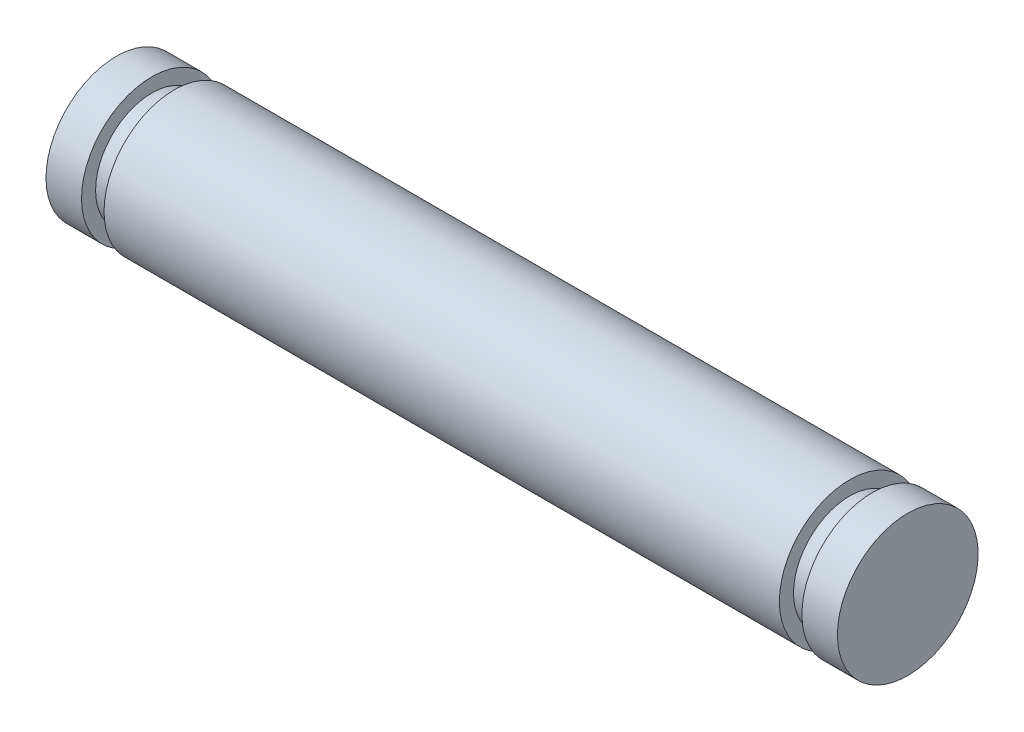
ISO-10303-21;
HEADER;
FILE_DESCRIPTION(('STEP AP214'),'2;1');
FILE_NAME('part.step','',(''),(''),'','','');
FILE_SCHEMA(('AUTOMOTIVE_DESIGN { 1 0 10303 214 1 1 1 1 }'));
ENDSEC;
DATA;
#1=APPLICATION_CONTEXT('core data for automotive mechanical design processes');
#2=APPLICATION_PROTOCOL_DEFINITION('international standard','automotive_design',2000,#1);
#3=PRODUCT_CONTEXT('',#1,'mechanical');
#4=PRODUCT('Part','Part','',(#3));
#5=PRODUCT_RELATED_PRODUCT_CATEGORY('part','',(#4));
#6=PRODUCT_DEFINITION_FORMATION('','',#4);
#7=PRODUCT_DEFINITION_CONTEXT('part definition',#1,'design');
#8=PRODUCT_DEFINITION('design','',#6,#7);
#9=PRODUCT_DEFINITION_SHAPE('','',#8);
#10=(LENGTH_UNIT() NAMED_UNIT(*) SI_UNIT(.MILLI.,.METRE.));
#11=(NAMED_UNIT(*) PLANE_ANGLE_UNIT() SI_UNIT($,.RADIAN.));
#12=(NAMED_UNIT(*) SI_UNIT($,.STERADIAN.) SOLID_ANGLE_UNIT());
#13=UNCERTAINTY_MEASURE_WITH_UNIT(LENGTH_MEASURE(1.E-05),#10,'distance_accuracy_value','');
#14=(GEOMETRIC_REPRESENTATION_CONTEXT(3) GLOBAL_UNCERTAINTY_ASSIGNED_CONTEXT((#13)) GLOBAL_UNIT_ASSIGNED_CONTEXT((#10,
#11,#12)) REPRESENTATION_CONTEXT('',''));
#15=CARTESIAN_POINT('',(0.,0.,0.));
#16=DIRECTION('',(0.,0.,1.));
#17=DIRECTION('',(1.,0.,0.));
#18=AXIS2_PLACEMENT_3D('',#15,#16,#17);
#19=CARTESIAN_POINT('',(11.25,0.,0.));
#20=DIRECTION('',(-1.,0.,0.));
#21=DIRECTION('',(0.,0.,1.));
#22=AXIS2_PLACEMENT_3D('',#19,#20,#21);
#23=CYLINDRICAL_SURFACE('',#22,2.);
#24=CARTESIAN_POINT('',(-9.6,0.,0.));
#25=DIRECTION('',(-1.,0.,0.));
#26=DIRECTION('',(0.,0.,1.));
#27=AXIS2_PLACEMENT_3D('',#24,#25,#26);
#28=CIRCLE('',#27,2.);
#29=CARTESIAN_POINT('',(-9.6,0.,2.));
#30=VERTEX_POINT('',#29);
#31=EDGE_CURVE('E49',#30,#30,#28,.T.);
#32=CARTESIAN_POINT('',(9.6,0.,0.));
#33=DIRECTION('',(-1.,0.,0.));
#34=DIRECTION('',(0.,0.,1.));
#35=AXIS2_PLACEMENT_3D('',#32,#33,#34);
#36=CIRCLE('',#35,2.);
#37=CARTESIAN_POINT('',(9.6,0.,2.));
#38=VERTEX_POINT('',#37);
#39=EDGE_CURVE('E61',#38,#38,#36,.T.);
#40=CARTESIAN_POINT('',(-9.6,0.,2.));
#41=CARTESIAN_POINT('',(-9.4,0.,2.));
#42=CARTESIAN_POINT('',(-9.2,0.,2.));
#43=CARTESIAN_POINT('',(-8.8,0.,2.));
#44=CARTESIAN_POINT('',(-8.6,0.,2.));
#45=CARTESIAN_POINT('',(-8.2,0.,2.));
#46=CARTESIAN_POINT('',(-8.,0.,2.));
#47=CARTESIAN_POINT('',(-7.6,0.,2.));
#48=CARTESIAN_POINT('',(-7.4,0.,2.));
#49=CARTESIAN_POINT('',(-7.,0.,2.));
#50=CARTESIAN_POINT('',(-6.8,0.,2.));
#51=CARTESIAN_POINT('',(-6.4,0.,2.));
#52=CARTESIAN_POINT('',(-6.2,0.,2.));
#53=CARTESIAN_POINT('',(-5.8,0.,2.));
#54=CARTESIAN_POINT('',(-5.6,0.,2.));
#55=CARTESIAN_POINT('',(-5.2,0.,2.));
#56=CARTESIAN_POINT('',(-5.,0.,2.));
#57=CARTESIAN_POINT('',(-4.6,0.,2.));
#58=CARTESIAN_POINT('',(-4.4,0.,2.));
#59=CARTESIAN_POINT('',(-4.,0.,2.));
#60=CARTESIAN_POINT('',(-3.8,0.,2.));
#61=CARTESIAN_POINT('',(-3.4,0.,2.));
#62=CARTESIAN_POINT('',(-3.2,0.,2.));
#63=CARTESIAN_POINT('',(-2.8,0.,2.));
#64=CARTESIAN_POINT('',(-2.6,0.,2.));
#65=CARTESIAN_POINT('',(-2.2,0.,2.));
#66=CARTESIAN_POINT('',(-2.,0.,2.));
#67=CARTESIAN_POINT('',(-1.6,0.,2.));
#68=CARTESIAN_POINT('',(-1.4,0.,2.));
#69=CARTESIAN_POINT('',(-0.999999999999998,0.,2.));
#70=CARTESIAN_POINT('',(-0.799999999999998,0.,2.));
#71=CARTESIAN_POINT('',(-0.399999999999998,0.,2.));
#72=CARTESIAN_POINT('',(-0.199999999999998,0.,2.));
#73=CARTESIAN_POINT('',(0.200000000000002,0.,2.));
#74=CARTESIAN_POINT('',(0.400000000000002,0.,2.));
#75=CARTESIAN_POINT('',(0.800000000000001,0.,2.));
#76=CARTESIAN_POINT('',(1.,0.,2.));
#77=CARTESIAN_POINT('',(1.4,0.,2.));
#78=CARTESIAN_POINT('',(1.6,0.,2.));
#79=CARTESIAN_POINT('',(2.,0.,2.));
#80=CARTESIAN_POINT('',(2.2,0.,2.));
#81=CARTESIAN_POINT('',(2.6,0.,2.));
#82=CARTESIAN_POINT('',(2.8,0.,2.));
#83=CARTESIAN_POINT('',(3.2,0.,2.));
#84=CARTESIAN_POINT('',(3.4,0.,2.));
#85=CARTESIAN_POINT('',(3.8,0.,2.));
#86=CARTESIAN_POINT('',(4.,0.,2.));
#87=CARTESIAN_POINT('',(4.4,0.,2.));
#88=CARTESIAN_POINT('',(4.6,0.,2.));
#89=CARTESIAN_POINT('',(5.,0.,2.));
#90=CARTESIAN_POINT('',(5.2,0.,2.));
#91=CARTESIAN_POINT('',(5.6,0.,2.));
#92=CARTESIAN_POINT('',(5.8,0.,2.));
#93=CARTESIAN_POINT('',(6.2,0.,2.));
#94=CARTESIAN_POINT('',(6.4,0.,2.));
#95=CARTESIAN_POINT('',(6.8,0.,2.));
#96=CARTESIAN_POINT('',(7.,0.,2.));
#97=CARTESIAN_POINT('',(7.4,0.,2.));
#98=CARTESIAN_POINT('',(7.6,0.,2.));
#99=CARTESIAN_POINT('',(8.,0.,2.));
#100=CARTESIAN_POINT('',(8.2,0.,2.));
#101=CARTESIAN_POINT('',(8.6,0.,2.));
#102=CARTESIAN_POINT('',(8.8,0.,2.));
#103=CARTESIAN_POINT('',(9.2,0.,2.));
#104=CARTESIAN_POINT('',(9.4,0.,2.));
#105=CARTESIAN_POINT('',(9.6,0.,2.));
#106=B_SPLINE_CURVE_WITH_KNOTS('',3,(#40,#41,#42,#43,#44,#45,#46,#47,#48,#49,#50,#51,#52,#53,
#54,#55,#56,#57,#58,#59,#60,#61,#62,#63,#64,#65,#66,#67,#68,#69,#70,#71,#72,#73,#74,#75,#76,#77,
#78,#79,#80,#81,#82,#83,#84,#85,#86,#87,#88,#89,#90,#91,#92,#93,#94,#95,#96,#97,#98,#99,#100,
#101,#102,#103,#104,#105),.UNSPECIFIED.,.F.,.F.,(4,2,2,2,2,2,2,2,2,2,2,2,2,2,2,2,2,2,2,2,2,2,2,
2,2,2,2,2,2,2,2,2,4),(0.,0.6,1.2,1.8,2.4,3.,3.6,4.2,4.8,5.4,6.,6.6,7.2,7.8,8.4,9.,9.6,10.2,10.8,
11.4,12.,12.6,13.2,13.8,14.4,15.,15.6,16.2,16.8,17.4,18.,18.6,19.2),.UNSPECIFIED.);
#107=EDGE_CURVE('BSEAM31',#30,#38,#106,.T.);
#108=ORIENTED_EDGE('',*,*,#31,.F.);
#109=ORIENTED_EDGE('',*,*,#39,.T.);
#110=ORIENTED_EDGE('',*,*,#107,.T.);
#111=ORIENTED_EDGE('',*,*,#107,.F.);
#112=EDGE_LOOP('',(#108,#110,#109,#111));
#113=FACE_BOUND('',#112,.T.);
#114=ADVANCED_FACE('F31',(#113),#23,.T.);
#115=CARTESIAN_POINT('',(-11.25,0.,0.));
#116=DIRECTION('',(1.,0.,0.));
#117=DIRECTION('',(0.,0.,-1.));
#118=AXIS2_PLACEMENT_3D('',#115,#116,#117);
#119=CIRCLE('',#118,2.);
#120=CARTESIAN_POINT('',(-11.25,0.,2.));
#121=VERTEX_POINT('',#120);
#122=EDGE_CURVE('E35',#121,#121,#119,.T.);
#123=CARTESIAN_POINT('',(-10.24,0.,0.));
#124=DIRECTION('',(-1.,0.,0.));
#125=DIRECTION('',(0.,0.,1.));
#126=AXIS2_PLACEMENT_3D('',#123,#124,#125);
#127=CIRCLE('',#126,2.);
#128=CARTESIAN_POINT('',(-10.24,0.,2.));
#129=VERTEX_POINT('',#128);
#130=EDGE_CURVE('E52',#129,#129,#127,.T.);
#131=CARTESIAN_POINT('',(-11.25,0.,2.));
#132=CARTESIAN_POINT('',(-11.2394791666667,0.,2.));
#133=CARTESIAN_POINT('',(-11.2289583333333,0.,2.));
#134=CARTESIAN_POINT('',(-11.2079166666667,0.,2.));
#135=CARTESIAN_POINT('',(-11.1973958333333,0.,2.));
#136=CARTESIAN_POINT('',(-11.1763541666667,0.,2.));
#137=CARTESIAN_POINT('',(-11.1658333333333,0.,2.));
#138=CARTESIAN_POINT('',(-11.1447916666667,0.,2.));
#139=CARTESIAN_POINT('',(-11.1342708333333,0.,2.));
#140=CARTESIAN_POINT('',(-11.1132291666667,0.,2.));
#141=CARTESIAN_POINT('',(-11.1027083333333,0.,2.));
#142=CARTESIAN_POINT('',(-11.0816666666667,0.,2.));
#143=CARTESIAN_POINT('',(-11.0711458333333,0.,2.));
#144=CARTESIAN_POINT('',(-11.0501041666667,0.,2.));
#145=CARTESIAN_POINT('',(-11.0395833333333,0.,2.));
#146=CARTESIAN_POINT('',(-11.0185416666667,0.,2.));
#147=CARTESIAN_POINT('',(-11.0080208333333,0.,2.));
#148=CARTESIAN_POINT('',(-10.9869791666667,0.,2.));
#149=CARTESIAN_POINT('',(-10.9764583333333,0.,2.));
#150=CARTESIAN_POINT('',(-10.9554166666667,0.,2.));
#151=CARTESIAN_POINT('',(-10.9448958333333,0.,2.));
#152=CARTESIAN_POINT('',(-10.9238541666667,0.,2.));
#153=CARTESIAN_POINT('',(-10.9133333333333,0.,2.));
#154=CARTESIAN_POINT('',(-10.8922916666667,0.,2.));
#155=CARTESIAN_POINT('',(-10.8817708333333,0.,2.));
#156=CARTESIAN_POINT('',(-10.8607291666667,0.,2.));
#157=CARTESIAN_POINT('',(-10.8502083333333,0.,2.));
#158=CARTESIAN_POINT('',(-10.8291666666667,0.,2.));
#159=CARTESIAN_POINT('',(-10.8186458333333,0.,2.));
#160=CARTESIAN_POINT('',(-10.7976041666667,0.,2.));
#161=CARTESIAN_POINT('',(-10.7870833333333,0.,2.));
#162=CARTESIAN_POINT('',(-10.7660416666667,0.,2.));
#163=CARTESIAN_POINT('',(-10.7555208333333,0.,2.));
#164=CARTESIAN_POINT('',(-10.7344791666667,0.,2.));
#165=CARTESIAN_POINT('',(-10.7239583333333,0.,2.));
#166=CARTESIAN_POINT('',(-10.7029166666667,0.,2.));
#167=CARTESIAN_POINT('',(-10.6923958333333,0.,2.));
#168=CARTESIAN_POINT('',(-10.6713541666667,0.,2.));
#169=CARTESIAN_POINT('',(-10.6608333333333,0.,2.));
#170=CARTESIAN_POINT('',(-10.6397916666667,0.,2.));
#171=CARTESIAN_POINT('',(-10.6292708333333,0.,2.));
#172=CARTESIAN_POINT('',(-10.6082291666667,0.,2.));
#173=CARTESIAN_POINT('',(-10.5977083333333,0.,2.));
#174=CARTESIAN_POINT('',(-10.5766666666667,0.,2.));
#175=CARTESIAN_POINT('',(-10.5661458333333,0.,2.));
#176=CARTESIAN_POINT('',(-10.5451041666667,0.,2.));
#177=CARTESIAN_POINT('',(-10.5345833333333,0.,2.));
#178=CARTESIAN_POINT('',(-10.5135416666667,0.,2.));
#179=CARTESIAN_POINT('',(-10.5030208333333,0.,2.));
#180=CARTESIAN_POINT('',(-10.4819791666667,0.,2.));
#181=CARTESIAN_POINT('',(-10.4714583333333,0.,2.));
#182=CARTESIAN_POINT('',(-10.4504166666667,0.,2.));
#183=CARTESIAN_POINT('',(-10.4398958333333,0.,2.));
#184=CARTESIAN_POINT('',(-10.4188541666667,0.,2.));
#185=CARTESIAN_POINT('',(-10.4083333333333,0.,2.));
#186=CARTESIAN_POINT('',(-10.3872916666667,0.,2.));
#187=CARTESIAN_POINT('',(-10.3767708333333,0.,2.));
#188=CARTESIAN_POINT('',(-10.3557291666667,0.,2.));
#189=CARTESIAN_POINT('',(-10.3452083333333,0.,2.));
#190=CARTESIAN_POINT('',(-10.3241666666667,0.,2.));
#191=CARTESIAN_POINT('',(-10.3136458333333,0.,2.));
#192=CARTESIAN_POINT('',(-10.2926041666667,0.,2.));
#193=CARTESIAN_POINT('',(-10.2820833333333,0.,2.));
#194=CARTESIAN_POINT('',(-10.2610416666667,0.,2.));
#195=CARTESIAN_POINT('',(-10.2505208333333,0.,2.));
#196=CARTESIAN_POINT('',(-10.24,0.,2.));
#197=B_SPLINE_CURVE_WITH_KNOTS('',3,(#131,#132,#133,#134,#135,#136,#137,#138,#139,#140,#141,
#142,#143,#144,#145,#146,#147,#148,#149,#150,#151,#152,#153,#154,#155,#156,#157,#158,#159,#160,
#161,#162,#163,#164,#165,#166,#167,#168,#169,#170,#171,#172,#173,#174,#175,#176,#177,#178,#179,
#180,#181,#182,#183,#184,#185,#186,#187,#188,#189,#190,#191,#192,#193,#194,#195,#196),
.UNSPECIFIED.,.F.,.F.,(4,2,2,2,2,2,2,2,2,2,2,2,2,2,2,2,2,2,2,2,2,2,2,2,2,2,2,2,2,2,2,2,4),(0.,
0.0315624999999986,0.0631250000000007,0.0946874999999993,0.126250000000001,0.1578125,
0.189375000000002,0.220937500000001,0.252500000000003,0.284062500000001,0.315625,
0.347187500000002,0.378750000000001,0.410312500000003,0.441875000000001,0.473437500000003,
0.505000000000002,0.536562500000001,0.568125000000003,0.599687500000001,0.631250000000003,
0.662812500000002,0.694375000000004,0.725937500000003,0.757500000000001,0.789062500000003,
0.820625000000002,0.852187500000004,0.883750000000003,0.915312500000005,0.946875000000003,
0.978437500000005,1.01),.UNSPECIFIED.);
#198=EDGE_CURVE('BSEAM33',#121,#129,#197,.T.);
#199=ORIENTED_EDGE('',*,*,#122,.T.);
#200=ORIENTED_EDGE('',*,*,#130,.T.);
#201=ORIENTED_EDGE('',*,*,#198,.T.);
#202=ORIENTED_EDGE('',*,*,#198,.F.);
#203=EDGE_LOOP('',(#199,#201,#200,#202));
#204=FACE_BOUND('',#203,.T.);
#205=ADVANCED_FACE('F33',(#204),#23,.T.);
#206=CARTESIAN_POINT('',(-11.25,0.,0.));
#207=DIRECTION('',(1.,0.,0.));
#208=DIRECTION('',(0.,0.,-1.));
#209=AXIS2_PLACEMENT_3D('',#206,#207,#208);
#210=PLANE('',#209);
#211=ORIENTED_EDGE('',*,*,#122,.F.);
#212=EDGE_LOOP('',(#211));
#213=FACE_BOUND('',#212,.T.);
#214=ADVANCED_FACE('F82',(#213),#210,.F.);
#215=CARTESIAN_POINT('',(-10.24,0.,-2.));
#216=DIRECTION('',(1.,0.,0.));
#217=DIRECTION('',(0.,0.,-1.));
#218=AXIS2_PLACEMENT_3D('',#215,#216,#217);
#219=PLANE('',#218);
#220=CARTESIAN_POINT('',(-10.24,0.,0.));
#221=DIRECTION('',(-1.,0.,0.));
#222=DIRECTION('',(0.,0.,1.));
#223=AXIS2_PLACEMENT_3D('',#220,#221,#222);
#224=CIRCLE('',#223,1.6);
#225=CARTESIAN_POINT('',(-10.24,0.,1.6));
#226=VERTEX_POINT('',#225);
#227=EDGE_CURVE('E42',#226,#226,#224,.T.);
#228=ORIENTED_EDGE('',*,*,#227,.T.);
#229=EDGE_LOOP('',(#228));
#230=FACE_BOUND('',#229,.T.);
#231=ORIENTED_EDGE('',*,*,#130,.F.);
#232=EDGE_LOOP('',(#231));
#233=FACE_BOUND('',#232,.T.);
#234=ADVANCED_FACE('F87',(#230,#233),#219,.T.);
#235=CARTESIAN_POINT('',(-12.375,0.,0.));
#236=DIRECTION('',(-1.,0.,0.));
#237=DIRECTION('',(0.,0.,1.));
#238=AXIS2_PLACEMENT_3D('',#235,#236,#237);
#239=CYLINDRICAL_SURFACE('',#238,1.6);
#240=CARTESIAN_POINT('',(-9.6,0.,0.));
#241=DIRECTION('',(-1.,0.,0.));
#242=DIRECTION('',(0.,0.,1.));
#243=AXIS2_PLACEMENT_3D('',#240,#241,#242);
#244=CIRCLE('',#243,1.6);
#245=CARTESIAN_POINT('',(-9.6,0.,1.6));
#246=VERTEX_POINT('',#245);
#247=EDGE_CURVE('E46',#246,#246,#244,.T.);
#248=ORIENTED_EDGE('',*,*,#247,.T.);
#249=EDGE_LOOP('',(#248));
#250=FACE_BOUND('',#249,.T.);
#251=ORIENTED_EDGE('',*,*,#227,.F.);
#252=EDGE_LOOP('',(#251));
#253=FACE_BOUND('',#252,.T.);
#254=ADVANCED_FACE('F94',(#250,#253),#239,.T.);
#255=CARTESIAN_POINT('',(-9.6,0.,-2.));
#256=DIRECTION('',(-1.,0.,0.));
#257=DIRECTION('',(0.,0.,1.));
#258=AXIS2_PLACEMENT_3D('',#255,#256,#257);
#259=PLANE('',#258);
#260=ORIENTED_EDGE('',*,*,#31,.T.);
#261=EDGE_LOOP('',(#260));
#262=FACE_BOUND('',#261,.T.);
#263=ORIENTED_EDGE('',*,*,#247,.F.);
#264=EDGE_LOOP('',(#263));
#265=FACE_BOUND('',#264,.T.);
#266=ADVANCED_FACE('F100',(#262,#265),#259,.T.);
#267=CARTESIAN_POINT('',(10.24,0.,-2.));
#268=DIRECTION('',(-1.,0.,0.));
#269=DIRECTION('',(0.,0.,-1.));
#270=AXIS2_PLACEMENT_3D('',#267,#268,#269);
#271=PLANE('',#270);
#272=CARTESIAN_POINT('',(10.24,0.,0.));
#273=DIRECTION('',(-1.,0.,0.));
#274=DIRECTION('',(0.,0.,1.));
#275=AXIS2_PLACEMENT_3D('',#272,#273,#274);
#276=CIRCLE('',#275,1.6);
#277=CARTESIAN_POINT('',(10.24,0.,1.6));
#278=VERTEX_POINT('',#277);
#279=EDGE_CURVE('E55',#278,#278,#276,.T.);
#280=ORIENTED_EDGE('',*,*,#279,.F.);
#281=EDGE_LOOP('',(#280));
#282=FACE_BOUND('',#281,.T.);
#283=CARTESIAN_POINT('',(10.24,0.,0.));
#284=DIRECTION('',(-1.,0.,0.));
#285=DIRECTION('',(0.,0.,1.));
#286=AXIS2_PLACEMENT_3D('',#283,#284,#285);
#287=CIRCLE('',#286,2.);
#288=CARTESIAN_POINT('',(10.24,0.,2.));
#289=VERTEX_POINT('',#288);
#290=EDGE_CURVE('E64',#289,#289,#287,.T.);
#291=ORIENTED_EDGE('',*,*,#290,.T.);
#292=EDGE_LOOP('',(#291));
#293=FACE_BOUND('',#292,.T.);
#294=ADVANCED_FACE('F68',(#282,#293),#271,.T.);
#295=CARTESIAN_POINT('',(12.375,0.,0.));
#296=DIRECTION('',(1.,0.,0.));
#297=DIRECTION('',(0.,0.,1.));
#298=AXIS2_PLACEMENT_3D('',#295,#296,#297);
#299=CYLINDRICAL_SURFACE('',#298,1.6);
#300=CARTESIAN_POINT('',(9.6,0.,0.));
#301=DIRECTION('',(-1.,0.,0.));
#302=DIRECTION('',(0.,0.,1.));
#303=AXIS2_PLACEMENT_3D('',#300,#301,#302);
#304=CIRCLE('',#303,1.6);
#305=CARTESIAN_POINT('',(9.6,0.,1.6));
#306=VERTEX_POINT('',#305);
#307=EDGE_CURVE('E58',#306,#306,#304,.T.);
#308=ORIENTED_EDGE('',*,*,#307,.F.);
#309=EDGE_LOOP('',(#308));
#310=FACE_BOUND('',#309,.T.);
#311=ORIENTED_EDGE('',*,*,#279,.T.);
#312=EDGE_LOOP('',(#311));
#313=FACE_BOUND('',#312,.T.);
#314=ADVANCED_FACE('F109',(#310,#313),#299,.T.);
#315=CARTESIAN_POINT('',(9.6,0.,-2.));
#316=DIRECTION('',(1.,0.,0.));
#317=DIRECTION('',(0.,0.,1.));
#318=AXIS2_PLACEMENT_3D('',#315,#316,#317);
#319=PLANE('',#318);
#320=ORIENTED_EDGE('',*,*,#39,.F.);
#321=EDGE_LOOP('',(#320));
#322=FACE_BOUND('',#321,.T.);
#323=ORIENTED_EDGE('',*,*,#307,.T.);
#324=EDGE_LOOP('',(#323));
#325=FACE_BOUND('',#324,.T.);
#326=ADVANCED_FACE('F77',(#322,#325),#319,.T.);
#327=CARTESIAN_POINT('',(11.25,0.,0.));
#328=DIRECTION('',(1.,0.,0.));
#329=DIRECTION('',(0.,0.,-1.));
#330=AXIS2_PLACEMENT_3D('',#327,#328,#329);
#331=PLANE('',#330);
#332=CARTESIAN_POINT('',(11.25,0.,0.));
#333=DIRECTION('',(1.,0.,0.));
#334=DIRECTION('',(0.,0.,-1.));
#335=AXIS2_PLACEMENT_3D('',#332,#333,#334);
#336=CIRCLE('',#335,2.);
#337=CARTESIAN_POINT('',(11.25,0.,2.));
#338=VERTEX_POINT('',#337);
#339=EDGE_CURVE('E10',#338,#338,#336,.T.);
#340=ORIENTED_EDGE('',*,*,#339,.T.);
#341=EDGE_LOOP('',(#340));
#342=FACE_BOUND('',#341,.T.);
#343=ADVANCED_FACE('F72',(#342),#331,.T.);
#344=CARTESIAN_POINT('',(11.25,0.,2.));
#345=CARTESIAN_POINT('',(11.2394791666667,0.,2.));
#346=CARTESIAN_POINT('',(11.2289583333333,0.,2.));
#347=CARTESIAN_POINT('',(11.2079166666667,0.,2.));
#348=CARTESIAN_POINT('',(11.1973958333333,0.,2.));
#349=CARTESIAN_POINT('',(11.1763541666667,0.,2.));
#350=CARTESIAN_POINT('',(11.1658333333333,0.,2.));
#351=CARTESIAN_POINT('',(11.1447916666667,0.,2.));
#352=CARTESIAN_POINT('',(11.1342708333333,0.,2.));
#353=CARTESIAN_POINT('',(11.1132291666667,0.,2.));
#354=CARTESIAN_POINT('',(11.1027083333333,0.,2.));
#355=CARTESIAN_POINT('',(11.0816666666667,0.,2.));
#356=CARTESIAN_POINT('',(11.0711458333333,0.,2.));
#357=CARTESIAN_POINT('',(11.0501041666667,0.,2.));
#358=CARTESIAN_POINT('',(11.0395833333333,0.,2.));
#359=CARTESIAN_POINT('',(11.0185416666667,0.,2.));
#360=CARTESIAN_POINT('',(11.0080208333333,0.,2.));
#361=CARTESIAN_POINT('',(10.9869791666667,0.,2.));
#362=CARTESIAN_POINT('',(10.9764583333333,0.,2.));
#363=CARTESIAN_POINT('',(10.9554166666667,0.,2.));
#364=CARTESIAN_POINT('',(10.9448958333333,0.,2.));
#365=CARTESIAN_POINT('',(10.9238541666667,0.,2.));
#366=CARTESIAN_POINT('',(10.9133333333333,0.,2.));
#367=CARTESIAN_POINT('',(10.8922916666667,0.,2.));
#368=CARTESIAN_POINT('',(10.8817708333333,0.,2.));
#369=CARTESIAN_POINT('',(10.8607291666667,0.,2.));
#370=CARTESIAN_POINT('',(10.8502083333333,0.,2.));
#371=CARTESIAN_POINT('',(10.8291666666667,0.,2.));
#372=CARTESIAN_POINT('',(10.8186458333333,0.,2.));
#373=CARTESIAN_POINT('',(10.7976041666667,0.,2.));
#374=CARTESIAN_POINT('',(10.7870833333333,0.,2.));
#375=CARTESIAN_POINT('',(10.7660416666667,0.,2.));
#376=CARTESIAN_POINT('',(10.7555208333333,0.,2.));
#377=CARTESIAN_POINT('',(10.7344791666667,0.,2.));
#378=CARTESIAN_POINT('',(10.7239583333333,0.,2.));
#379=CARTESIAN_POINT('',(10.7029166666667,0.,2.));
#380=CARTESIAN_POINT('',(10.6923958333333,0.,2.));
#381=CARTESIAN_POINT('',(10.6713541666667,0.,2.));
#382=CARTESIAN_POINT('',(10.6608333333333,0.,2.));
#383=CARTESIAN_POINT('',(10.6397916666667,0.,2.));
#384=CARTESIAN_POINT('',(10.6292708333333,0.,2.));
#385=CARTESIAN_POINT('',(10.6082291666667,0.,2.));
#386=CARTESIAN_POINT('',(10.5977083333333,0.,2.));
#387=CARTESIAN_POINT('',(10.5766666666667,0.,2.));
#388=CARTESIAN_POINT('',(10.5661458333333,0.,2.));
#389=CARTESIAN_POINT('',(10.5451041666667,0.,2.));
#390=CARTESIAN_POINT('',(10.5345833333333,0.,2.));
#391=CARTESIAN_POINT('',(10.5135416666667,0.,2.));
#392=CARTESIAN_POINT('',(10.5030208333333,0.,2.));
#393=CARTESIAN_POINT('',(10.4819791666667,0.,2.));
#394=CARTESIAN_POINT('',(10.4714583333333,0.,2.));
#395=CARTESIAN_POINT('',(10.4504166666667,0.,2.));
#396=CARTESIAN_POINT('',(10.4398958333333,0.,2.));
#397=CARTESIAN_POINT('',(10.4188541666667,0.,2.));
#398=CARTESIAN_POINT('',(10.4083333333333,0.,2.));
#399=CARTESIAN_POINT('',(10.3872916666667,0.,2.));
#400=CARTESIAN_POINT('',(10.3767708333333,0.,2.));
#401=CARTESIAN_POINT('',(10.3557291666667,0.,2.));
#402=CARTESIAN_POINT('',(10.3452083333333,0.,2.));
#403=CARTESIAN_POINT('',(10.3241666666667,0.,2.));
#404=CARTESIAN_POINT('',(10.3136458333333,0.,2.));
#405=CARTESIAN_POINT('',(10.2926041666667,0.,2.));
#406=CARTESIAN_POINT('',(10.2820833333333,0.,2.));
#407=CARTESIAN_POINT('',(10.2610416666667,0.,2.));
#408=CARTESIAN_POINT('',(10.2505208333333,0.,2.));
#409=CARTESIAN_POINT('',(10.24,0.,2.));
#410=B_SPLINE_CURVE_WITH_KNOTS('',3,(#344,#345,#346,#347,#348,#349,#350,#351,#352,#353,#354,
#355,#356,#357,#358,#359,#360,#361,#362,#363,#364,#365,#366,#367,#368,#369,#370,#371,#372,#373,
#374,#375,#376,#377,#378,#379,#380,#381,#382,#383,#384,#385,#386,#387,#388,#389,#390,#391,#392,
#393,#394,#395,#396,#397,#398,#399,#400,#401,#402,#403,#404,#405,#406,#407,#408,#409),
.UNSPECIFIED.,.F.,.F.,(4,2,2,2,2,2,2,2,2,2,2,2,2,2,2,2,2,2,2,2,2,2,2,2,2,2,2,2,2,2,2,2,4),(0.,
0.0315624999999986,0.0631249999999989,0.0946874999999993,0.12625,0.157812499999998,
0.189374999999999,0.220937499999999,0.252499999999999,0.2840625,0.315624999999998,
0.347187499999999,0.378749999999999,0.410312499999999,0.441874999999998,0.473437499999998,
0.504999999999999,0.536562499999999,0.568124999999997,0.599687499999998,0.631249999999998,
0.662812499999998,0.694374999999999,0.725937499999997,0.757499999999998,0.789062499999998,
0.820624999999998,0.852187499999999,0.883749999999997,0.915312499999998,0.946874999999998,
0.978437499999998,1.01),.UNSPECIFIED.);
#411=EDGE_CURVE('BSEAM70',#338,#289,#410,.T.);
#412=ORIENTED_EDGE('',*,*,#339,.F.);
#413=ORIENTED_EDGE('',*,*,#290,.F.);
#414=ORIENTED_EDGE('',*,*,#411,.T.);
#415=ORIENTED_EDGE('',*,*,#411,.F.);
#416=EDGE_LOOP('',(#412,#414,#413,#415));
#417=FACE_BOUND('',#416,.T.);
#418=ADVANCED_FACE('F70',(#417),#23,.T.);
#419=CLOSED_SHELL('',(#114,#205,#214,#234,#254,#266,#294,#314,#326,#343,#418));
#420=MANIFOLD_SOLID_BREP('B2',#419);
#421=ADVANCED_BREP_SHAPE_REPRESENTATION('',(#18,#420),#14);
#422=SHAPE_DEFINITION_REPRESENTATION(#9,#421);
ENDSEC;
END-ISO-10303-21;
